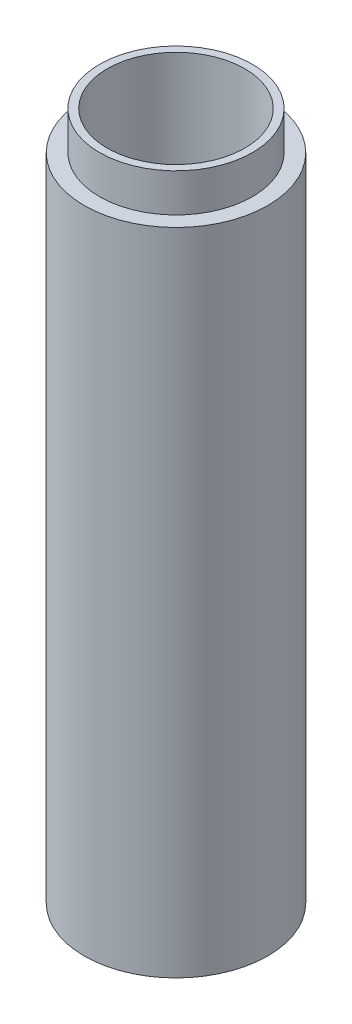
ISO-10303-21;
HEADER;
FILE_DESCRIPTION(('STEP AP214'),'2;1');
FILE_NAME('part.step','',(''),(''),'','','');
FILE_SCHEMA(('AUTOMOTIVE_DESIGN { 1 0 10303 214 1 1 1 1 }'));
ENDSEC;
DATA;
#1=APPLICATION_CONTEXT('core data for automotive mechanical design processes');
#2=APPLICATION_PROTOCOL_DEFINITION('international standard','automotive_design',2000,#1);
#3=PRODUCT_CONTEXT('',#1,'mechanical');
#4=PRODUCT('Part','Part','',(#3));
#5=PRODUCT_RELATED_PRODUCT_CATEGORY('part','',(#4));
#6=PRODUCT_DEFINITION_FORMATION('','',#4);
#7=PRODUCT_DEFINITION_CONTEXT('part definition',#1,'design');
#8=PRODUCT_DEFINITION('design','',#6,#7);
#9=PRODUCT_DEFINITION_SHAPE('','',#8);
#10=(LENGTH_UNIT() NAMED_UNIT(*) SI_UNIT(.MILLI.,.METRE.));
#11=(NAMED_UNIT(*) PLANE_ANGLE_UNIT() SI_UNIT($,.RADIAN.));
#12=(NAMED_UNIT(*) SI_UNIT($,.STERADIAN.) SOLID_ANGLE_UNIT());
#13=UNCERTAINTY_MEASURE_WITH_UNIT(LENGTH_MEASURE(1.E-05),#10,'distance_accuracy_value','');
#14=(GEOMETRIC_REPRESENTATION_CONTEXT(3) GLOBAL_UNCERTAINTY_ASSIGNED_CONTEXT((#13)) GLOBAL_UNIT_ASSIGNED_CONTEXT((#10,
#11,#12)) REPRESENTATION_CONTEXT('',''));
#15=CARTESIAN_POINT('',(0.,0.,0.));
#16=DIRECTION('',(0.,0.,1.));
#17=DIRECTION('',(1.,0.,0.));
#18=AXIS2_PLACEMENT_3D('',#15,#16,#17);
#19=CARTESIAN_POINT('',(0.,45.,0.));
#20=DIRECTION('',(0.,1.,0.));
#21=DIRECTION('',(0.,0.,1.));
#22=AXIS2_PLACEMENT_3D('',#19,#20,#21);
#23=PLANE('',#22);
#24=CARTESIAN_POINT('',(0.,45.,0.));
#25=DIRECTION('',(0.,1.,0.));
#26=DIRECTION('',(0.,0.,1.));
#27=AXIS2_PLACEMENT_3D('',#24,#25,#26);
#28=CIRCLE('',#27,9.);
#29=CARTESIAN_POINT('',(0.,45.,-9.));
#30=VERTEX_POINT('',#29);
#31=EDGE_CURVE('E39',#30,#30,#28,.T.);
#32=ORIENTED_EDGE('',*,*,#31,.F.);
#33=EDGE_LOOP('',(#32));
#34=FACE_BOUND('',#33,.T.);
#35=CARTESIAN_POINT('',(0.,45.,0.));
#36=DIRECTION('',(0.,1.,0.));
#37=DIRECTION('',(0.,0.,1.));
#38=AXIS2_PLACEMENT_3D('',#35,#36,#37);
#39=CIRCLE('',#38,10.);
#40=CARTESIAN_POINT('',(0.,45.,10.));
#41=VERTEX_POINT('',#40);
#42=EDGE_CURVE('E53',#41,#41,#39,.T.);
#43=ORIENTED_EDGE('',*,*,#42,.T.);
#44=EDGE_LOOP('',(#43));
#45=FACE_BOUND('',#44,.T.);
#46=ADVANCED_FACE('F32',(#34,#45),#23,.T.);
#47=CARTESIAN_POINT('',(0.,45.,0.));
#48=DIRECTION('',(0.,-1.,0.));
#49=DIRECTION('',(0.,0.,-1.));
#50=AXIS2_PLACEMENT_3D('',#47,#48,#49);
#51=CYLINDRICAL_SURFACE('',#50,12.);
#52=CARTESIAN_POINT('',(0.,-45.,0.));
#53=DIRECTION('',(0.,1.,0.));
#54=DIRECTION('',(0.,0.,1.));
#55=AXIS2_PLACEMENT_3D('',#52,#53,#54);
#56=CIRCLE('',#55,12.);
#57=CARTESIAN_POINT('',(0.,-45.,-12.));
#58=VERTEX_POINT('',#57);
#59=EDGE_CURVE('E10',#58,#58,#56,.T.);
#60=CARTESIAN_POINT('',(0.,40.,0.));
#61=DIRECTION('',(0.,1.,0.));
#62=DIRECTION('',(0.,0.,1.));
#63=AXIS2_PLACEMENT_3D('',#60,#61,#62);
#64=CIRCLE('',#63,12.);
#65=CARTESIAN_POINT('',(0.,40.,-12.));
#66=VERTEX_POINT('',#65);
#67=EDGE_CURVE('E48',#66,#66,#64,.T.);
#68=CARTESIAN_POINT('',(0.,-45.,-12.));
#69=CARTESIAN_POINT('',(0.,-44.1145833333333,-12.));
#70=CARTESIAN_POINT('',(0.,-43.2291666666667,-12.));
#71=CARTESIAN_POINT('',(0.,-41.4583333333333,-12.));
#72=CARTESIAN_POINT('',(0.,-40.5729166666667,-12.));
#73=CARTESIAN_POINT('',(0.,-38.8020833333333,-12.));
#74=CARTESIAN_POINT('',(0.,-37.9166666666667,-12.));
#75=CARTESIAN_POINT('',(0.,-36.1458333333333,-12.));
#76=CARTESIAN_POINT('',(0.,-35.2604166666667,-12.));
#77=CARTESIAN_POINT('',(0.,-33.4895833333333,-12.));
#78=CARTESIAN_POINT('',(0.,-32.6041666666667,-12.));
#79=CARTESIAN_POINT('',(0.,-30.8333333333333,-12.));
#80=CARTESIAN_POINT('',(0.,-29.9479166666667,-12.));
#81=CARTESIAN_POINT('',(0.,-28.1770833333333,-12.));
#82=CARTESIAN_POINT('',(0.,-27.2916666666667,-12.));
#83=CARTESIAN_POINT('',(0.,-25.5208333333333,-12.));
#84=CARTESIAN_POINT('',(0.,-24.6354166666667,-12.));
#85=CARTESIAN_POINT('',(0.,-22.8645833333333,-12.));
#86=CARTESIAN_POINT('',(0.,-21.9791666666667,-12.));
#87=CARTESIAN_POINT('',(0.,-20.2083333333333,-12.));
#88=CARTESIAN_POINT('',(0.,-19.3229166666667,-12.));
#89=CARTESIAN_POINT('',(0.,-17.5520833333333,-12.));
#90=CARTESIAN_POINT('',(0.,-16.6666666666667,-12.));
#91=CARTESIAN_POINT('',(0.,-14.8958333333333,-12.));
#92=CARTESIAN_POINT('',(0.,-14.0104166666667,-12.));
#93=CARTESIAN_POINT('',(0.,-12.2395833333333,-12.));
#94=CARTESIAN_POINT('',(0.,-11.3541666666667,-12.));
#95=CARTESIAN_POINT('',(0.,-9.58333333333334,-12.));
#96=CARTESIAN_POINT('',(0.,-8.69791666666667,-12.));
#97=CARTESIAN_POINT('',(0.,-6.92708333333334,-12.));
#98=CARTESIAN_POINT('',(0.,-6.04166666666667,-12.));
#99=CARTESIAN_POINT('',(0.,-4.27083333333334,-12.));
#100=CARTESIAN_POINT('',(0.,-3.38541666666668,-12.));
#101=CARTESIAN_POINT('',(0.,-1.61458333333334,-12.));
#102=CARTESIAN_POINT('',(0.,-0.729166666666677,-12.));
#103=CARTESIAN_POINT('',(0.,1.04166666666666,-12.));
#104=CARTESIAN_POINT('',(0.,1.92708333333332,-12.));
#105=CARTESIAN_POINT('',(0.,3.69791666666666,-12.));
#106=CARTESIAN_POINT('',(0.,4.58333333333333,-12.));
#107=CARTESIAN_POINT('',(0.,6.35416666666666,-12.));
#108=CARTESIAN_POINT('',(0.,7.23958333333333,-12.));
#109=CARTESIAN_POINT('',(0.,9.01041666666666,-12.));
#110=CARTESIAN_POINT('',(0.,9.89583333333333,-12.));
#111=CARTESIAN_POINT('',(0.,11.6666666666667,-12.));
#112=CARTESIAN_POINT('',(0.,12.5520833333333,-12.));
#113=CARTESIAN_POINT('',(0.,14.3229166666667,-12.));
#114=CARTESIAN_POINT('',(0.,15.2083333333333,-12.));
#115=CARTESIAN_POINT('',(0.,16.9791666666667,-12.));
#116=CARTESIAN_POINT('',(0.,17.8645833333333,-12.));
#117=CARTESIAN_POINT('',(0.,19.6354166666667,-12.));
#118=CARTESIAN_POINT('',(0.,20.5208333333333,-12.));
#119=CARTESIAN_POINT('',(0.,22.2916666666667,-12.));
#120=CARTESIAN_POINT('',(0.,23.1770833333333,-12.));
#121=CARTESIAN_POINT('',(0.,24.9479166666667,-12.));
#122=CARTESIAN_POINT('',(0.,25.8333333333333,-12.));
#123=CARTESIAN_POINT('',(0.,27.6041666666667,-12.));
#124=CARTESIAN_POINT('',(0.,28.4895833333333,-12.));
#125=CARTESIAN_POINT('',(0.,30.2604166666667,-12.));
#126=CARTESIAN_POINT('',(0.,31.1458333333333,-12.));
#127=CARTESIAN_POINT('',(0.,32.9166666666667,-12.));
#128=CARTESIAN_POINT('',(0.,33.8020833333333,-12.));
#129=CARTESIAN_POINT('',(0.,35.5729166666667,-12.));
#130=CARTESIAN_POINT('',(0.,36.4583333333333,-12.));
#131=CARTESIAN_POINT('',(0.,38.2291666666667,-12.));
#132=CARTESIAN_POINT('',(0.,39.1145833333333,-12.));
#133=CARTESIAN_POINT('',(0.,40.,-12.));
#134=B_SPLINE_CURVE_WITH_KNOTS('',3,(#68,#69,#70,#71,#72,#73,#74,#75,#76,#77,#78,#79,#80,#81,
#82,#83,#84,#85,#86,#87,#88,#89,#90,#91,#92,#93,#94,#95,#96,#97,#98,#99,#100,#101,#102,#103,
#104,#105,#106,#107,#108,#109,#110,#111,#112,#113,#114,#115,#116,#117,#118,#119,#120,#121,#122,
#123,#124,#125,#126,#127,#128,#129,#130,#131,#132,#133),.UNSPECIFIED.,.F.,.F.,(4,2,2,2,2,2,2,2,
2,2,2,2,2,2,2,2,2,2,2,2,2,2,2,2,2,2,2,2,2,2,2,2,4),(0.,2.65625,5.3125,7.96875,10.625,13.28125,
15.9375,18.59375,21.25,23.90625,26.5625,29.21875,31.875,34.53125,37.1875,39.84375,42.5,45.15625,
47.8125,50.46875,53.125,55.78125,58.4375,61.09375,63.75,66.40625,69.0625,71.71875,74.375,
77.03125,79.6875,82.34375,85.),.UNSPECIFIED.);
#135=EDGE_CURVE('BSEAM34',#58,#66,#134,.T.);
#136=ORIENTED_EDGE('',*,*,#59,.T.);
#137=ORIENTED_EDGE('',*,*,#67,.F.);
#138=ORIENTED_EDGE('',*,*,#135,.T.);
#139=ORIENTED_EDGE('',*,*,#135,.F.);
#140=EDGE_LOOP('',(#136,#138,#137,#139));
#141=FACE_BOUND('',#140,.T.);
#142=ADVANCED_FACE('F34',(#141),#51,.T.);
#143=CARTESIAN_POINT('',(0.,-45.,0.));
#144=DIRECTION('',(0.,1.,0.));
#145=DIRECTION('',(0.,0.,1.));
#146=AXIS2_PLACEMENT_3D('',#143,#144,#145);
#147=PLANE('',#146);
#148=ORIENTED_EDGE('',*,*,#59,.F.);
#149=EDGE_LOOP('',(#148));
#150=FACE_BOUND('',#149,.T.);
#151=CARTESIAN_POINT('',(0.,-45.,0.));
#152=DIRECTION('',(0.,1.,0.));
#153=DIRECTION('',(0.,0.,1.));
#154=AXIS2_PLACEMENT_3D('',#151,#152,#153);
#155=CIRCLE('',#154,9.);
#156=CARTESIAN_POINT('',(0.,-45.,-9.));
#157=VERTEX_POINT('',#156);
#158=EDGE_CURVE('E43',#157,#157,#155,.T.);
#159=ORIENTED_EDGE('',*,*,#158,.T.);
#160=EDGE_LOOP('',(#159));
#161=FACE_BOUND('',#160,.T.);
#162=ADVANCED_FACE('F70',(#150,#161),#147,.F.);
#163=CARTESIAN_POINT('',(0.,45.,0.));
#164=DIRECTION('',(0.,-1.,0.));
#165=DIRECTION('',(0.,0.,-1.));
#166=AXIS2_PLACEMENT_3D('',#163,#164,#165);
#167=CYLINDRICAL_SURFACE('',#166,9.);
#168=CARTESIAN_POINT('',(0.,45.,-9.));
#169=CARTESIAN_POINT('',(0.,44.0625,-9.));
#170=CARTESIAN_POINT('',(0.,43.125,-9.));
#171=CARTESIAN_POINT('',(0.,41.25,-9.));
#172=CARTESIAN_POINT('',(0.,40.3125,-9.));
#173=CARTESIAN_POINT('',(0.,38.4375,-9.));
#174=CARTESIAN_POINT('',(0.,37.5,-9.));
#175=CARTESIAN_POINT('',(0.,35.625,-9.));
#176=CARTESIAN_POINT('',(0.,34.6875,-9.));
#177=CARTESIAN_POINT('',(0.,32.8125,-9.));
#178=CARTESIAN_POINT('',(0.,31.875,-9.));
#179=CARTESIAN_POINT('',(0.,30.,-9.));
#180=CARTESIAN_POINT('',(0.,29.0625,-9.));
#181=CARTESIAN_POINT('',(0.,27.1875,-9.));
#182=CARTESIAN_POINT('',(0.,26.25,-9.));
#183=CARTESIAN_POINT('',(0.,24.375,-9.));
#184=CARTESIAN_POINT('',(0.,23.4375,-9.));
#185=CARTESIAN_POINT('',(0.,21.5625,-9.));
#186=CARTESIAN_POINT('',(0.,20.625,-9.));
#187=CARTESIAN_POINT('',(0.,18.75,-9.));
#188=CARTESIAN_POINT('',(0.,17.8125,-9.));
#189=CARTESIAN_POINT('',(0.,15.9375,-9.));
#190=CARTESIAN_POINT('',(0.,15.,-9.));
#191=CARTESIAN_POINT('',(0.,13.125,-9.));
#192=CARTESIAN_POINT('',(0.,12.1875,-9.));
#193=CARTESIAN_POINT('',(0.,10.3125,-9.));
#194=CARTESIAN_POINT('',(0.,9.37499999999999,-9.));
#195=CARTESIAN_POINT('',(0.,7.5,-9.));
#196=CARTESIAN_POINT('',(0.,6.5625,-9.));
#197=CARTESIAN_POINT('',(0.,4.6875,-9.));
#198=CARTESIAN_POINT('',(0.,3.75,-9.));
#199=CARTESIAN_POINT('',(0.,1.87499999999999,-9.));
#200=CARTESIAN_POINT('',(0.,0.937499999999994,-9.));
#201=CARTESIAN_POINT('',(0.,-0.937500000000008,-9.));
#202=CARTESIAN_POINT('',(0.,-1.87500000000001,-9.));
#203=CARTESIAN_POINT('',(0.,-3.75000000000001,-9.));
#204=CARTESIAN_POINT('',(0.,-4.68750000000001,-9.));
#205=CARTESIAN_POINT('',(0.,-6.56250000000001,-9.));
#206=CARTESIAN_POINT('',(0.,-7.50000000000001,-9.));
#207=CARTESIAN_POINT('',(0.,-9.37500000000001,-9.));
#208=CARTESIAN_POINT('',(0.,-10.3125,-9.));
#209=CARTESIAN_POINT('',(0.,-12.1875,-9.));
#210=CARTESIAN_POINT('',(0.,-13.125,-9.));
#211=CARTESIAN_POINT('',(0.,-15.,-9.));
#212=CARTESIAN_POINT('',(0.,-15.9375,-9.));
#213=CARTESIAN_POINT('',(0.,-17.8125,-9.));
#214=CARTESIAN_POINT('',(0.,-18.75,-9.));
#215=CARTESIAN_POINT('',(0.,-20.625,-9.));
#216=CARTESIAN_POINT('',(0.,-21.5625,-9.));
#217=CARTESIAN_POINT('',(0.,-23.4375,-9.));
#218=CARTESIAN_POINT('',(0.,-24.375,-9.));
#219=CARTESIAN_POINT('',(0.,-26.25,-9.));
#220=CARTESIAN_POINT('',(0.,-27.1875,-9.));
#221=CARTESIAN_POINT('',(0.,-29.0625,-9.));
#222=CARTESIAN_POINT('',(0.,-30.,-9.));
#223=CARTESIAN_POINT('',(0.,-31.875,-9.));
#224=CARTESIAN_POINT('',(0.,-32.8125,-9.));
#225=CARTESIAN_POINT('',(0.,-34.6875,-9.));
#226=CARTESIAN_POINT('',(0.,-35.625,-9.));
#227=CARTESIAN_POINT('',(0.,-37.5,-9.));
#228=CARTESIAN_POINT('',(0.,-38.4375,-9.));
#229=CARTESIAN_POINT('',(0.,-40.3125,-9.));
#230=CARTESIAN_POINT('',(0.,-41.25,-9.));
#231=CARTESIAN_POINT('',(0.,-43.125,-9.));
#232=CARTESIAN_POINT('',(0.,-44.0625,-9.));
#233=CARTESIAN_POINT('',(0.,-45.,-9.));
#234=B_SPLINE_CURVE_WITH_KNOTS('',3,(#168,#169,#170,#171,#172,#173,#174,#175,#176,#177,#178,
#179,#180,#181,#182,#183,#184,#185,#186,#187,#188,#189,#190,#191,#192,#193,#194,#195,#196,#197,
#198,#199,#200,#201,#202,#203,#204,#205,#206,#207,#208,#209,#210,#211,#212,#213,#214,#215,#216,
#217,#218,#219,#220,#221,#222,#223,#224,#225,#226,#227,#228,#229,#230,#231,#232,#233),
.UNSPECIFIED.,.F.,.F.,(4,2,2,2,2,2,2,2,2,2,2,2,2,2,2,2,2,2,2,2,2,2,2,2,2,2,2,2,2,2,2,2,4),(0.,
2.8125,5.62500000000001,8.4375,11.25,14.0625,16.875,19.6875,22.5,25.3125,28.125,30.9375,33.75,
36.5625,39.375,42.1875,45.,47.8125,50.625,53.4375,56.25,59.0625,61.875,64.6875,67.5,70.3125,
73.125,75.9375,78.75,81.5625,84.375,87.1875,90.),.UNSPECIFIED.);
#235=EDGE_CURVE('BSEAM65',#30,#157,#234,.T.);
#236=ORIENTED_EDGE('',*,*,#31,.T.);
#237=ORIENTED_EDGE('',*,*,#158,.F.);
#238=ORIENTED_EDGE('',*,*,#235,.T.);
#239=ORIENTED_EDGE('',*,*,#235,.F.);
#240=EDGE_LOOP('',(#236,#238,#237,#239));
#241=FACE_BOUND('',#240,.T.);
#242=ADVANCED_FACE('F65',(#241),#167,.F.);
#243=CARTESIAN_POINT('',(0.,40.,0.));
#244=DIRECTION('',(0.,1.,0.));
#245=DIRECTION('',(0.,0.,1.));
#246=AXIS2_PLACEMENT_3D('',#243,#244,#245);
#247=PLANE('',#246);
#248=CARTESIAN_POINT('',(0.,40.,0.));
#249=DIRECTION('',(0.,1.,0.));
#250=DIRECTION('',(0.,0.,1.));
#251=AXIS2_PLACEMENT_3D('',#248,#249,#250);
#252=CIRCLE('',#251,10.);
#253=CARTESIAN_POINT('',(0.,40.,10.));
#254=VERTEX_POINT('',#253);
#255=EDGE_CURVE('E52',#254,#254,#252,.T.);
#256=ORIENTED_EDGE('',*,*,#255,.F.);
#257=EDGE_LOOP('',(#256));
#258=FACE_BOUND('',#257,.T.);
#259=ORIENTED_EDGE('',*,*,#67,.T.);
#260=EDGE_LOOP('',(#259));
#261=FACE_BOUND('',#260,.T.);
#262=ADVANCED_FACE('F62',(#258,#261),#247,.T.);
#263=CARTESIAN_POINT('',(0.,40.,0.));
#264=DIRECTION('',(0.,1.,0.));
#265=DIRECTION('',(0.,0.,1.));
#266=AXIS2_PLACEMENT_3D('',#263,#264,#265);
#267=CYLINDRICAL_SURFACE('',#266,10.);
#268=ORIENTED_EDGE('',*,*,#255,.T.);
#269=EDGE_LOOP('',(#268));
#270=FACE_BOUND('',#269,.T.);
#271=ORIENTED_EDGE('',*,*,#42,.F.);
#272=EDGE_LOOP('',(#271));
#273=FACE_BOUND('',#272,.T.);
#274=ADVANCED_FACE('F59',(#270,#273),#267,.T.);
#275=CLOSED_SHELL('',(#46,#142,#162,#242,#262,#274));
#276=MANIFOLD_SOLID_BREP('B2',#275);
#277=ADVANCED_BREP_SHAPE_REPRESENTATION('',(#18,#276),#14);
#278=SHAPE_DEFINITION_REPRESENTATION(#9,#277);
ENDSEC;
END-ISO-10303-21;
